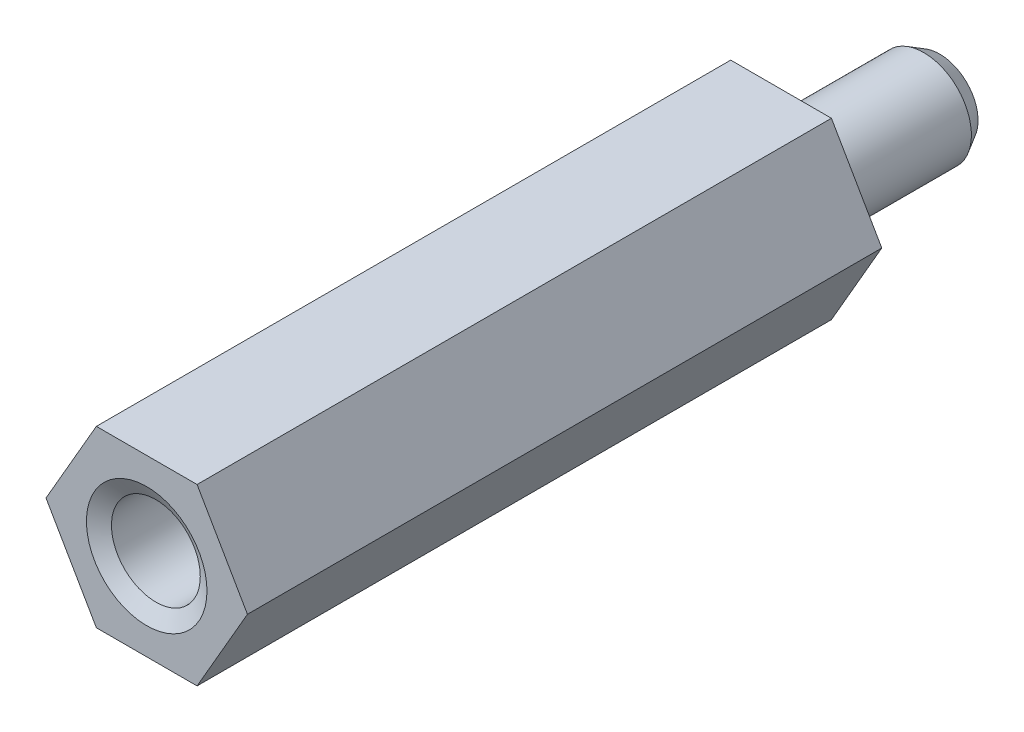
ISO-10303-21;
HEADER;
FILE_DESCRIPTION(('STEP AP214'),'2;1');
FILE_NAME('part.step','',(''),(''),'','','');
FILE_SCHEMA(('AUTOMOTIVE_DESIGN { 1 0 10303 214 1 1 1 1 }'));
ENDSEC;
DATA;
#1=APPLICATION_CONTEXT('core data for automotive mechanical design processes');
#2=APPLICATION_PROTOCOL_DEFINITION('international standard','automotive_design',2000,#1);
#3=PRODUCT_CONTEXT('',#1,'mechanical');
#4=PRODUCT('Part','Part','',(#3));
#5=PRODUCT_RELATED_PRODUCT_CATEGORY('part','',(#4));
#6=PRODUCT_DEFINITION_FORMATION('','',#4);
#7=PRODUCT_DEFINITION_CONTEXT('part definition',#1,'design');
#8=PRODUCT_DEFINITION('design','',#6,#7);
#9=PRODUCT_DEFINITION_SHAPE('','',#8);
#10=(LENGTH_UNIT() NAMED_UNIT(*) SI_UNIT(.MILLI.,.METRE.));
#11=(NAMED_UNIT(*) PLANE_ANGLE_UNIT() SI_UNIT($,.RADIAN.));
#12=(NAMED_UNIT(*) SI_UNIT($,.STERADIAN.) SOLID_ANGLE_UNIT());
#13=UNCERTAINTY_MEASURE_WITH_UNIT(LENGTH_MEASURE(1.E-05),#10,'distance_accuracy_value','');
#14=(GEOMETRIC_REPRESENTATION_CONTEXT(3) GLOBAL_UNCERTAINTY_ASSIGNED_CONTEXT((#13)) GLOBAL_UNIT_ASSIGNED_CONTEXT((#10,
#11,#12)) REPRESENTATION_CONTEXT('',''));
#15=CARTESIAN_POINT('',(0.,0.,0.));
#16=DIRECTION('',(0.,0.,1.));
#17=DIRECTION('',(1.,0.,0.));
#18=AXIS2_PLACEMENT_3D('',#15,#16,#17);
#19=CARTESIAN_POINT('',(3.17542648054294,0.,20.));
#20=DIRECTION('',(-0.866025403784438,-0.5,0.));
#21=DIRECTION('',(0.5,-0.866025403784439,0.));
#22=AXIS2_PLACEMENT_3D('',#19,#20,#21);
#23=PLANE('',#22);
#24=DIRECTION('',(-0.5,0.866025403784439,0.));
#25=VECTOR('',#24,1.);
#26=CARTESIAN_POINT('',(3.17542648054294,0.,0.));
#27=LINE('',#26,#25);
#28=CARTESIAN_POINT('',(3.17542648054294,0.,0.));
#29=VERTEX_POINT('',#28);
#30=CARTESIAN_POINT('',(1.58771324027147,2.75,0.));
#31=VERTEX_POINT('',#30);
#32=EDGE_CURVE('E132',#29,#31,#27,.T.);
#33=ORIENTED_EDGE('',*,*,#32,.T.);
#34=DIRECTION('',(0.,0.,-1.));
#35=VECTOR('',#34,1.);
#36=CARTESIAN_POINT('',(1.58771324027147,2.75,20.));
#37=LINE('',#36,#35);
#38=CARTESIAN_POINT('',(1.58771324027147,2.75,20.));
#39=VERTEX_POINT('',#38);
#40=EDGE_CURVE('E149',#39,#31,#37,.T.);
#41=ORIENTED_EDGE('',*,*,#40,.F.);
#42=DIRECTION('',(-0.5,0.866025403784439,0.));
#43=VECTOR('',#42,1.);
#44=CARTESIAN_POINT('',(3.17542648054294,0.,20.));
#45=LINE('',#44,#43);
#46=CARTESIAN_POINT('',(3.17542648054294,0.,20.));
#47=VERTEX_POINT('',#46);
#48=EDGE_CURVE('E142',#47,#39,#45,.T.);
#49=ORIENTED_EDGE('',*,*,#48,.F.);
#50=DIRECTION('',(0.,0.,-1.));
#51=VECTOR('',#50,1.);
#52=CARTESIAN_POINT('',(3.17542648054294,0.,20.));
#53=LINE('',#52,#51);
#54=EDGE_CURVE('E128',#47,#29,#53,.T.);
#55=ORIENTED_EDGE('',*,*,#54,.T.);
#56=EDGE_LOOP('',(#33,#41,#49,#55));
#57=FACE_BOUND('',#56,.T.);
#58=ADVANCED_FACE('F46',(#57),#23,.F.);
#59=CARTESIAN_POINT('',(1.58771324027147,2.75,20.));
#60=DIRECTION('',(0.,-1.,0.));
#61=DIRECTION('',(0.,0.,-1.));
#62=AXIS2_PLACEMENT_3D('',#59,#60,#61);
#63=PLANE('',#62);
#64=DIRECTION('',(-1.,0.,0.));
#65=VECTOR('',#64,1.);
#66=CARTESIAN_POINT('',(1.58771324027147,2.75,0.));
#67=LINE('',#66,#65);
#68=CARTESIAN_POINT('',(-1.58771324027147,2.75,0.));
#69=VERTEX_POINT('',#68);
#70=EDGE_CURVE('E135',#31,#69,#67,.T.);
#71=ORIENTED_EDGE('',*,*,#70,.T.);
#72=DIRECTION('',(0.,0.,-1.));
#73=VECTOR('',#72,1.);
#74=CARTESIAN_POINT('',(-1.58771324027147,2.75,20.));
#75=LINE('',#74,#73);
#76=CARTESIAN_POINT('',(-1.58771324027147,2.75,20.));
#77=VERTEX_POINT('',#76);
#78=EDGE_CURVE('E146',#77,#69,#75,.T.);
#79=ORIENTED_EDGE('',*,*,#78,.F.);
#80=DIRECTION('',(-1.,0.,0.));
#81=VECTOR('',#80,1.);
#82=CARTESIAN_POINT('',(1.58771324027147,2.75,20.));
#83=LINE('',#82,#81);
#84=EDGE_CURVE('E101',#39,#77,#83,.T.);
#85=ORIENTED_EDGE('',*,*,#84,.F.);
#86=ORIENTED_EDGE('',*,*,#40,.T.);
#87=EDGE_LOOP('',(#71,#79,#85,#86));
#88=FACE_BOUND('',#87,.T.);
#89=ADVANCED_FACE('F179',(#88),#63,.F.);
#90=CARTESIAN_POINT('',(-1.58771324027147,2.75,20.));
#91=DIRECTION('',(0.866025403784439,-0.5,0.));
#92=DIRECTION('',(0.5,0.866025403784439,0.));
#93=AXIS2_PLACEMENT_3D('',#90,#91,#92);
#94=PLANE('',#93);
#95=DIRECTION('',(-0.5,-0.866025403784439,0.));
#96=VECTOR('',#95,1.);
#97=CARTESIAN_POINT('',(-1.58771324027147,2.75,0.));
#98=LINE('',#97,#96);
#99=CARTESIAN_POINT('',(-3.17542648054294,0.,0.));
#100=VERTEX_POINT('',#99);
#101=EDGE_CURVE('E137',#69,#100,#98,.T.);
#102=ORIENTED_EDGE('',*,*,#101,.T.);
#103=DIRECTION('',(0.,0.,-1.));
#104=VECTOR('',#103,1.);
#105=CARTESIAN_POINT('',(-3.17542648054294,0.,20.));
#106=LINE('',#105,#104);
#107=CARTESIAN_POINT('',(-3.17542648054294,0.,20.));
#108=VERTEX_POINT('',#107);
#109=EDGE_CURVE('E123',#108,#100,#106,.T.);
#110=ORIENTED_EDGE('',*,*,#109,.F.);
#111=DIRECTION('',(-0.5,-0.866025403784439,0.));
#112=VECTOR('',#111,1.);
#113=CARTESIAN_POINT('',(-1.58771324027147,2.75,20.));
#114=LINE('',#113,#112);
#115=EDGE_CURVE('E114',#77,#108,#114,.T.);
#116=ORIENTED_EDGE('',*,*,#115,.F.);
#117=ORIENTED_EDGE('',*,*,#78,.T.);
#118=EDGE_LOOP('',(#102,#110,#116,#117));
#119=FACE_BOUND('',#118,.T.);
#120=ADVANCED_FACE('F185',(#119),#94,.F.);
#121=CARTESIAN_POINT('',(-3.17542648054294,0.,20.));
#122=DIRECTION('',(0.866025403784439,0.5,0.));
#123=DIRECTION('',(-0.5,0.866025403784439,0.));
#124=AXIS2_PLACEMENT_3D('',#121,#122,#123);
#125=PLANE('',#124);
#126=DIRECTION('',(0.5,-0.866025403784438,0.));
#127=VECTOR('',#126,1.);
#128=CARTESIAN_POINT('',(-3.17542648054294,0.,0.));
#129=LINE('',#128,#127);
#130=CARTESIAN_POINT('',(-1.58771324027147,-2.75,0.));
#131=VERTEX_POINT('',#130);
#132=EDGE_CURVE('E122',#100,#131,#129,.T.);
#133=ORIENTED_EDGE('',*,*,#132,.T.);
#134=DIRECTION('',(0.,0.,-1.));
#135=VECTOR('',#134,1.);
#136=CARTESIAN_POINT('',(-1.58771324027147,-2.75,20.));
#137=LINE('',#136,#135);
#138=CARTESIAN_POINT('',(-1.58771324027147,-2.75,20.));
#139=VERTEX_POINT('',#138);
#140=EDGE_CURVE('E119',#139,#131,#137,.T.);
#141=ORIENTED_EDGE('',*,*,#140,.F.);
#142=DIRECTION('',(0.5,-0.866025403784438,0.));
#143=VECTOR('',#142,1.);
#144=CARTESIAN_POINT('',(-3.17542648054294,0.,20.));
#145=LINE('',#144,#143);
#146=EDGE_CURVE('E108',#108,#139,#145,.T.);
#147=ORIENTED_EDGE('',*,*,#146,.F.);
#148=ORIENTED_EDGE('',*,*,#109,.T.);
#149=EDGE_LOOP('',(#133,#141,#147,#148));
#150=FACE_BOUND('',#149,.T.);
#151=ADVANCED_FACE('F120',(#150),#125,.F.);
#152=CARTESIAN_POINT('',(-1.58771324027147,-2.75,20.));
#153=DIRECTION('',(0.,1.,0.));
#154=DIRECTION('',(-1.,0.,0.));
#155=AXIS2_PLACEMENT_3D('',#152,#153,#154);
#156=PLANE('',#155);
#157=DIRECTION('',(1.,0.,0.));
#158=VECTOR('',#157,1.);
#159=CARTESIAN_POINT('',(-1.58771324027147,-2.75,0.));
#160=LINE('',#159,#158);
#161=CARTESIAN_POINT('',(1.58771324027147,-2.75,0.));
#162=VERTEX_POINT('',#161);
#163=EDGE_CURVE('E86',#131,#162,#160,.T.);
#164=ORIENTED_EDGE('',*,*,#163,.T.);
#165=DIRECTION('',(0.,0.,-1.));
#166=VECTOR('',#165,1.);
#167=CARTESIAN_POINT('',(1.58771324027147,-2.75,20.));
#168=LINE('',#167,#166);
#169=CARTESIAN_POINT('',(1.58771324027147,-2.75,20.));
#170=VERTEX_POINT('',#169);
#171=EDGE_CURVE('E124',#170,#162,#168,.T.);
#172=ORIENTED_EDGE('',*,*,#171,.F.);
#173=DIRECTION('',(1.,0.,0.));
#174=VECTOR('',#173,1.);
#175=CARTESIAN_POINT('',(-1.58771324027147,-2.75,20.));
#176=LINE('',#175,#174);
#177=EDGE_CURVE('E112',#139,#170,#176,.T.);
#178=ORIENTED_EDGE('',*,*,#177,.F.);
#179=ORIENTED_EDGE('',*,*,#140,.T.);
#180=EDGE_LOOP('',(#164,#172,#178,#179));
#181=FACE_BOUND('',#180,.T.);
#182=ADVANCED_FACE('F126',(#181),#156,.F.);
#183=CARTESIAN_POINT('',(1.58771324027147,-2.75,20.));
#184=DIRECTION('',(-0.866025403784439,0.5,0.));
#185=DIRECTION('',(-0.5,-0.866025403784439,0.));
#186=AXIS2_PLACEMENT_3D('',#183,#184,#185);
#187=PLANE('',#186);
#188=DIRECTION('',(0.5,0.866025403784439,0.));
#189=VECTOR('',#188,1.);
#190=CARTESIAN_POINT('',(1.58771324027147,-2.75,0.));
#191=LINE('',#190,#189);
#192=EDGE_CURVE('E92',#162,#29,#191,.T.);
#193=ORIENTED_EDGE('',*,*,#192,.T.);
#194=ORIENTED_EDGE('',*,*,#54,.F.);
#195=DIRECTION('',(0.5,0.866025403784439,0.));
#196=VECTOR('',#195,1.);
#197=CARTESIAN_POINT('',(1.58771324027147,-2.75,20.));
#198=LINE('',#197,#196);
#199=EDGE_CURVE('E63',#170,#47,#198,.T.);
#200=ORIENTED_EDGE('',*,*,#199,.F.);
#201=ORIENTED_EDGE('',*,*,#171,.T.);
#202=EDGE_LOOP('',(#193,#194,#200,#201));
#203=FACE_BOUND('',#202,.T.);
#204=ADVANCED_FACE('F221',(#203),#187,.F.);
#205=CARTESIAN_POINT('',(0.,0.,20.));
#206=DIRECTION('',(0.,0.,1.));
#207=DIRECTION('',(1.,0.,0.));
#208=AXIS2_PLACEMENT_3D('',#205,#206,#207);
#209=PLANE('',#208);
#210=CARTESIAN_POINT('',(0.,0.,20.));
#211=DIRECTION('',(0.,0.,1.));
#212=DIRECTION('',(1.,0.,0.));
#213=AXIS2_PLACEMENT_3D('',#210,#211,#212);
#214=CIRCLE('',#213,1.90000000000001);
#215=CARTESIAN_POINT('',(1.90000000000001,0.,20.));
#216=VERTEX_POINT('',#215);
#217=EDGE_CURVE('E13',#216,#216,#214,.F.);
#218=ORIENTED_EDGE('',*,*,#217,.T.);
#219=EDGE_LOOP('',(#218));
#220=FACE_BOUND('',#219,.T.);
#221=ORIENTED_EDGE('',*,*,#48,.T.);
#222=ORIENTED_EDGE('',*,*,#84,.T.);
#223=ORIENTED_EDGE('',*,*,#115,.T.);
#224=ORIENTED_EDGE('',*,*,#146,.T.);
#225=ORIENTED_EDGE('',*,*,#177,.T.);
#226=ORIENTED_EDGE('',*,*,#199,.T.);
#227=EDGE_LOOP('',(#221,#222,#223,#224,#225,#226));
#228=FACE_BOUND('',#227,.T.);
#229=ADVANCED_FACE('F110',(#220,#228),#209,.T.);
#230=CARTESIAN_POINT('',(0.,0.,0.));
#231=DIRECTION('',(0.,0.,1.));
#232=DIRECTION('',(1.,0.,0.));
#233=AXIS2_PLACEMENT_3D('',#230,#231,#232);
#234=PLANE('',#233);
#235=CARTESIAN_POINT('',(0.,0.,0.));
#236=DIRECTION('',(0.,0.,-1.));
#237=DIRECTION('',(-1.,0.,0.));
#238=AXIS2_PLACEMENT_3D('',#235,#236,#237);
#239=CIRCLE('',#238,1.5);
#240=CARTESIAN_POINT('',(-1.5,0.,0.));
#241=VERTEX_POINT('',#240);
#242=EDGE_CURVE('E151',#241,#241,#239,.T.);
#243=ORIENTED_EDGE('',*,*,#242,.F.);
#244=EDGE_LOOP('',(#243));
#245=FACE_BOUND('',#244,.T.);
#246=ORIENTED_EDGE('',*,*,#32,.F.);
#247=ORIENTED_EDGE('',*,*,#192,.F.);
#248=ORIENTED_EDGE('',*,*,#163,.F.);
#249=ORIENTED_EDGE('',*,*,#132,.F.);
#250=ORIENTED_EDGE('',*,*,#101,.F.);
#251=ORIENTED_EDGE('',*,*,#70,.F.);
#252=EDGE_LOOP('',(#246,#247,#248,#249,#250,#251));
#253=FACE_BOUND('',#252,.T.);
#254=ADVANCED_FACE('F207',(#245,#253),#234,.F.);
#255=CARTESIAN_POINT('',(0.,0.,-5.));
#256=DIRECTION('',(0.,0.,1.));
#257=DIRECTION('',(1.,0.,0.));
#258=AXIS2_PLACEMENT_3D('',#255,#256,#257);
#259=CYLINDRICAL_SURFACE('',#258,1.5);
#260=CARTESIAN_POINT('',(0.,0.,-4.5));
#261=DIRECTION('',(0.,0.,-1.));
#262=DIRECTION('',(-1.,0.,0.));
#263=AXIS2_PLACEMENT_3D('',#260,#261,#262);
#264=CIRCLE('',#263,1.5);
#265=CARTESIAN_POINT('',(-1.5,0.,-4.5));
#266=VERTEX_POINT('',#265);
#267=EDGE_CURVE('E155',#266,#266,#264,.F.);
#268=ORIENTED_EDGE('',*,*,#267,.T.);
#269=EDGE_LOOP('',(#268));
#270=FACE_BOUND('',#269,.T.);
#271=ORIENTED_EDGE('',*,*,#242,.T.);
#272=EDGE_LOOP('',(#271));
#273=FACE_BOUND('',#272,.T.);
#274=ADVANCED_FACE('F198',(#270,#273),#259,.T.);
#275=CARTESIAN_POINT('',(0.,0.,-5.));
#276=DIRECTION('',(0.,0.,-1.));
#277=DIRECTION('',(-1.,0.,0.));
#278=AXIS2_PLACEMENT_3D('',#275,#276,#277);
#279=PLANE('',#278);
#280=CARTESIAN_POINT('',(0.,0.,-5.));
#281=DIRECTION('',(0.,0.,-1.));
#282=DIRECTION('',(-1.,0.,0.));
#283=AXIS2_PLACEMENT_3D('',#280,#281,#282);
#284=CIRCLE('',#283,1.21132486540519);
#285=CARTESIAN_POINT('',(-1.21132486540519,0.,-5.));
#286=VERTEX_POINT('',#285);
#287=EDGE_CURVE('E152',#286,#286,#284,.T.);
#288=ORIENTED_EDGE('',*,*,#287,.T.);
#289=EDGE_LOOP('',(#288));
#290=FACE_BOUND('',#289,.T.);
#291=ADVANCED_FACE('F191',(#290),#279,.T.);
#292=CARTESIAN_POINT('',(0.,0.,-5.));
#293=DIRECTION('',(0.,0.,1.));
#294=DIRECTION('',(1.,0.,0.));
#295=AXIS2_PLACEMENT_3D('',#292,#293,#294);
#296=CONICAL_SURFACE('',#295,1.21132486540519,0.523598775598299);
#297=ORIENTED_EDGE('',*,*,#267,.F.);
#298=EDGE_LOOP('',(#297));
#299=FACE_BOUND('',#298,.T.);
#300=ORIENTED_EDGE('',*,*,#287,.F.);
#301=EDGE_LOOP('',(#300));
#302=FACE_BOUND('',#301,.T.);
#303=ADVANCED_FACE('F189',(#299,#302),#296,.T.);
#304=CARTESIAN_POINT('',(0.,0.,14.));
#305=DIRECTION('',(0.,0.,1.));
#306=DIRECTION('',(1.,0.,0.));
#307=AXIS2_PLACEMENT_3D('',#304,#305,#306);
#308=CYLINDRICAL_SURFACE('',#307,1.4);
#309=CARTESIAN_POINT('',(0.,0.,19.7113248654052));
#310=DIRECTION('',(0.,0.,1.));
#311=DIRECTION('',(1.,0.,0.));
#312=AXIS2_PLACEMENT_3D('',#309,#310,#311);
#313=CIRCLE('',#312,1.4);
#314=CARTESIAN_POINT('',(1.4,0.,19.7113248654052));
#315=VERTEX_POINT('',#314);
#316=EDGE_CURVE('E55',#315,#315,#313,.T.);
#317=ORIENTED_EDGE('',*,*,#316,.T.);
#318=EDGE_LOOP('',(#317));
#319=FACE_BOUND('',#318,.T.);
#320=CARTESIAN_POINT('',(0.,0.,14.6928203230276));
#321=DIRECTION('',(0.,0.,1.));
#322=DIRECTION('',(1.,0.,0.));
#323=AXIS2_PLACEMENT_3D('',#320,#321,#322);
#324=CIRCLE('',#323,1.4);
#325=CARTESIAN_POINT('',(1.4,0.,14.6928203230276));
#326=VERTEX_POINT('',#325);
#327=EDGE_CURVE('E161',#326,#326,#324,.F.);
#328=ORIENTED_EDGE('',*,*,#327,.T.);
#329=EDGE_LOOP('',(#328));
#330=FACE_BOUND('',#329,.T.);
#331=ADVANCED_FACE('F166',(#319,#330),#308,.F.);
#332=CARTESIAN_POINT('',(0.,0.,14.));
#333=DIRECTION('',(0.,0.,1.));
#334=DIRECTION('',(1.,0.,0.));
#335=AXIS2_PLACEMENT_3D('',#332,#333,#334);
#336=PLANE('',#335);
#337=CARTESIAN_POINT('',(0.,0.,14.));
#338=DIRECTION('',(0.,0.,1.));
#339=DIRECTION('',(1.,0.,0.));
#340=AXIS2_PLACEMENT_3D('',#337,#338,#339);
#341=CIRCLE('',#340,0.200000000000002);
#342=CARTESIAN_POINT('',(0.200000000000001,0.,14.));
#343=VERTEX_POINT('',#342);
#344=EDGE_CURVE('E158',#343,#343,#341,.T.);
#345=ORIENTED_EDGE('',*,*,#344,.T.);
#346=EDGE_LOOP('',(#345));
#347=FACE_BOUND('',#346,.T.);
#348=ADVANCED_FACE('F175',(#347),#336,.T.);
#349=CARTESIAN_POINT('',(0.,0.,14.));
#350=DIRECTION('',(0.,0.,1.));
#351=DIRECTION('',(1.,0.,0.));
#352=AXIS2_PLACEMENT_3D('',#349,#350,#351);
#353=CONICAL_SURFACE('',#352,0.200000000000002,1.04719755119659);
#354=CARTESIAN_POINT('',(1.4,0.,14.6928203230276));
#355=CARTESIAN_POINT('',(1.3875,0.,14.6856034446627));
#356=CARTESIAN_POINT('',(1.375,0.,14.6783865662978));
#357=CARTESIAN_POINT('',(1.35,0.,14.6639528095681));
#358=CARTESIAN_POINT('',(1.3375,0.,14.6567359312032));
#359=CARTESIAN_POINT('',(1.3125,0.,14.6423021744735));
#360=CARTESIAN_POINT('',(1.3,0.,14.6350852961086));
#361=CARTESIAN_POINT('',(1.275,0.,14.6206515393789));
#362=CARTESIAN_POINT('',(1.2625,0.,14.613434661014));
#363=CARTESIAN_POINT('',(1.2375,0.,14.5990009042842));
#364=CARTESIAN_POINT('',(1.225,0.,14.5917840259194));
#365=CARTESIAN_POINT('',(1.2,0.,14.5773502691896));
#366=CARTESIAN_POINT('',(1.1875,0.,14.5701333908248));
#367=CARTESIAN_POINT('',(1.1625,0.,14.555699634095));
#368=CARTESIAN_POINT('',(1.15,0.,14.5484827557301));
#369=CARTESIAN_POINT('',(1.125,0.,14.5340489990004));
#370=CARTESIAN_POINT('',(1.1125,0.,14.5268321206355));
#371=CARTESIAN_POINT('',(1.0875,0.,14.5123983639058));
#372=CARTESIAN_POINT('',(1.075,0.,14.5051814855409));
#373=CARTESIAN_POINT('',(1.05,0.,14.4907477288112));
#374=CARTESIAN_POINT('',(1.0375,0.,14.4835308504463));
#375=CARTESIAN_POINT('',(1.0125,0.,14.4690970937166));
#376=CARTESIAN_POINT('',(0.999999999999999,0.,14.4618802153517));
#377=CARTESIAN_POINT('',(0.974999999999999,0.,14.447446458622));
#378=CARTESIAN_POINT('',(0.962499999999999,0.,14.4402295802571));
#379=CARTESIAN_POINT('',(0.937499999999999,0.,14.4257958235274));
#380=CARTESIAN_POINT('',(0.924999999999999,0.,14.4185789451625));
#381=CARTESIAN_POINT('',(0.9,0.,14.4041451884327));
#382=CARTESIAN_POINT('',(0.887499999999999,0.,14.3969283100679));
#383=CARTESIAN_POINT('',(0.862499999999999,0.,14.3824945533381));
#384=CARTESIAN_POINT('',(0.85,0.,14.3752776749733));
#385=CARTESIAN_POINT('',(0.825,0.,14.3608439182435));
#386=CARTESIAN_POINT('',(0.8125,0.,14.3536270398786));
#387=CARTESIAN_POINT('',(0.7875,0.,14.3391932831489));
#388=CARTESIAN_POINT('',(0.775,0.,14.331976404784));
#389=CARTESIAN_POINT('',(0.75,0.,14.3175426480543));
#390=CARTESIAN_POINT('',(0.7375,0.,14.3103257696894));
#391=CARTESIAN_POINT('',(0.7125,0.,14.2958920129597));
#392=CARTESIAN_POINT('',(0.7,0.,14.2886751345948));
#393=CARTESIAN_POINT('',(0.675,0.,14.2742413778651));
#394=CARTESIAN_POINT('',(0.6625,0.,14.2670244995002));
#395=CARTESIAN_POINT('',(0.6375,0.,14.2525907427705));
#396=CARTESIAN_POINT('',(0.625,0.,14.2453738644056));
#397=CARTESIAN_POINT('',(0.6,0.,14.2309401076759));
#398=CARTESIAN_POINT('',(0.5875,0.,14.223723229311));
#399=CARTESIAN_POINT('',(0.5625,0.,14.2092894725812));
#400=CARTESIAN_POINT('',(0.55,0.,14.2020725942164));
#401=CARTESIAN_POINT('',(0.525,0.,14.1876388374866));
#402=CARTESIAN_POINT('',(0.5125,0.,14.1804219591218));
#403=CARTESIAN_POINT('',(0.4875,0.,14.165988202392));
#404=CARTESIAN_POINT('',(0.475,0.,14.1587713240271));
#405=CARTESIAN_POINT('',(0.45,0.,14.1443375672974));
#406=CARTESIAN_POINT('',(0.4375,0.,14.1371206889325));
#407=CARTESIAN_POINT('',(0.4125,0.,14.1226869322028));
#408=CARTESIAN_POINT('',(0.4,0.,14.1154700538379));
#409=CARTESIAN_POINT('',(0.375000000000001,0.,14.1010362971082));
#410=CARTESIAN_POINT('',(0.362500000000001,0.,14.0938194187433));
#411=CARTESIAN_POINT('',(0.3375,0.,14.0793856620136));
#412=CARTESIAN_POINT('',(0.325,0.,14.0721687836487));
#413=CARTESIAN_POINT('',(0.3,0.,14.057735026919));
#414=CARTESIAN_POINT('',(0.287500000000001,0.,14.0505181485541));
#415=CARTESIAN_POINT('',(0.262500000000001,0.,14.0360843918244));
#416=CARTESIAN_POINT('',(0.250000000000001,0.,14.0288675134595));
#417=CARTESIAN_POINT('',(0.225,0.,14.0144337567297));
#418=CARTESIAN_POINT('',(0.2125,0.,14.0072168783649));
#419=CARTESIAN_POINT('',(0.200000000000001,0.,14.));
#420=B_SPLINE_CURVE_WITH_KNOTS('',3,(#354,#355,#356,#357,#358,#359,#360,#361,#362,#363,#364,
#365,#366,#367,#368,#369,#370,#371,#372,#373,#374,#375,#376,#377,#378,#379,#380,#381,#382,#383,
#384,#385,#386,#387,#388,#389,#390,#391,#392,#393,#394,#395,#396,#397,#398,#399,#400,#401,#402,
#403,#404,#405,#406,#407,#408,#409,#410,#411,#412,#413,#414,#415,#416,#417,#418,#419),
.UNSPECIFIED.,.F.,.F.,(4,2,2,2,2,2,2,2,2,2,2,2,2,2,2,2,2,2,2,2,2,2,2,2,2,2,2,2,2,2,2,2,4),(0.,
0.0433012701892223,0.0866025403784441,0.129903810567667,0.173205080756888,0.216506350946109,
0.259807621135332,0.303108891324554,0.346410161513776,0.389711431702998,0.43301270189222,
0.476313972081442,0.519615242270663,0.562916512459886,0.606217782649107,0.64951905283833,
0.692820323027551,0.736121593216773,0.779422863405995,0.822724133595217,0.866025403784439,
0.909326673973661,0.952627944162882,0.995929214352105,1.03923048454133,1.08253175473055,
1.12583302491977,1.16913429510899,1.21243556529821,1.25573683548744,1.29903810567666,
1.34233937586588,1.3856406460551),.UNSPECIFIED.);
#421=EDGE_CURVE('BSEAM170',#326,#343,#420,.T.);
#422=ORIENTED_EDGE('',*,*,#327,.F.);
#423=ORIENTED_EDGE('',*,*,#344,.F.);
#424=ORIENTED_EDGE('',*,*,#421,.T.);
#425=ORIENTED_EDGE('',*,*,#421,.F.);
#426=EDGE_LOOP('',(#422,#424,#423,#425));
#427=FACE_BOUND('',#426,.T.);
#428=ADVANCED_FACE('F170',(#427),#353,.F.);
#429=CARTESIAN_POINT('',(0.,0.,19.7113248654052));
#430=DIRECTION('',(0.,0.,1.));
#431=DIRECTION('',(1.,0.,0.));
#432=AXIS2_PLACEMENT_3D('',#429,#430,#431);
#433=CONICAL_SURFACE('',#432,1.4,1.04719755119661);
#434=ORIENTED_EDGE('',*,*,#217,.F.);
#435=EDGE_LOOP('',(#434));
#436=FACE_BOUND('',#435,.T.);
#437=ORIENTED_EDGE('',*,*,#316,.F.);
#438=EDGE_LOOP('',(#437));
#439=FACE_BOUND('',#438,.T.);
#440=ADVANCED_FACE('F48',(#436,#439),#433,.F.);
#441=CLOSED_SHELL('',(#58,#89,#120,#151,#182,#204,#229,#254,#274,#291,#303,#331,#348,#428,#440));
#442=MANIFOLD_SOLID_BREP('B2',#441);
#443=ADVANCED_BREP_SHAPE_REPRESENTATION('',(#18,#442),#14);
#444=SHAPE_DEFINITION_REPRESENTATION(#9,#443);
ENDSEC;
END-ISO-10303-21;
